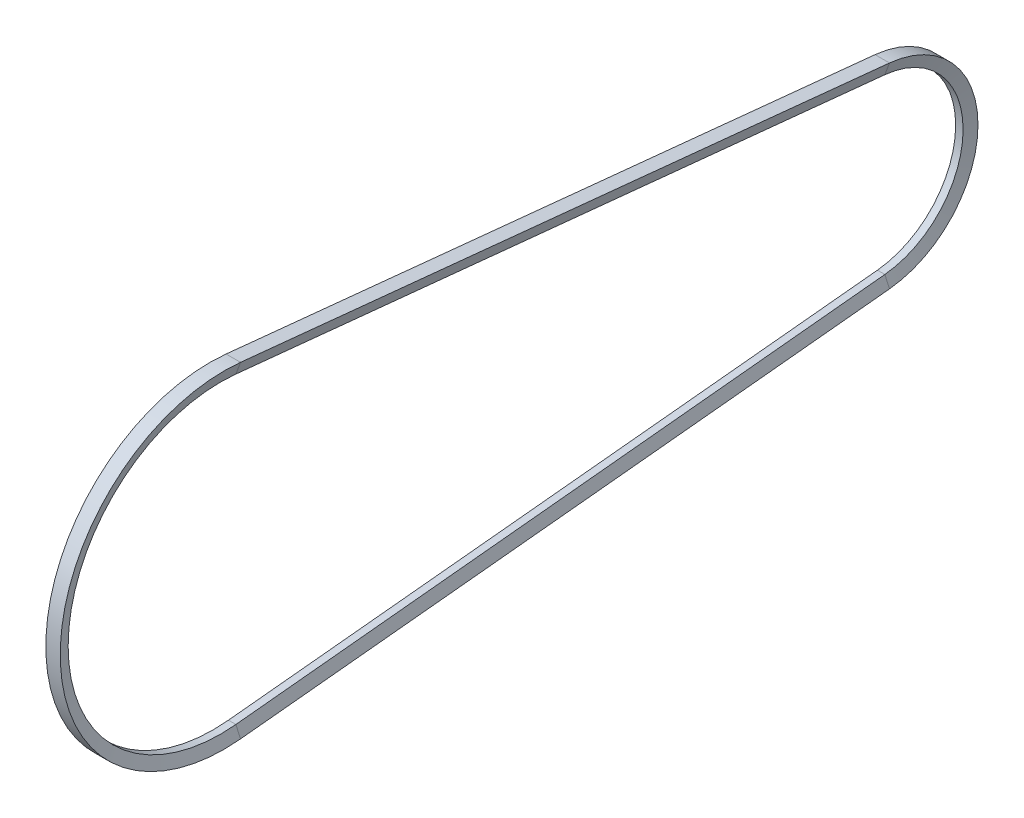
from build123d import *


with BuildPart() as part:
    # Sweep 1: sweep along a path in Sketch 1
    with BuildLine(Plane(origin=(0, 0, 0), x_dir=(0, 0, -1), z_dir=(1, 0, 0))) as sweep_1_path:
        Line((12.5, 124.373429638), (507.5, 74.624057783))
        ThreePointArc((507.5, 74.624057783), (575, 0), (507.5, -74.624057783))
        Line((507.5, -74.624057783), (12.5, -124.373429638))
        ThreePointArc((12.5, -124.373429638), (-125, 0), (12.5, 124.373429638))
    # Sketch 2 → Sweep 1 (sweep)
    with BuildSketch(Plane.XY):
        Polygon((-5.5, 125), (5.5, 125), (2.840143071, 116.3), (-2.840143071, 116.3), align=None)
    sweep(path=sweep_1_path.line)


solid = part.part
